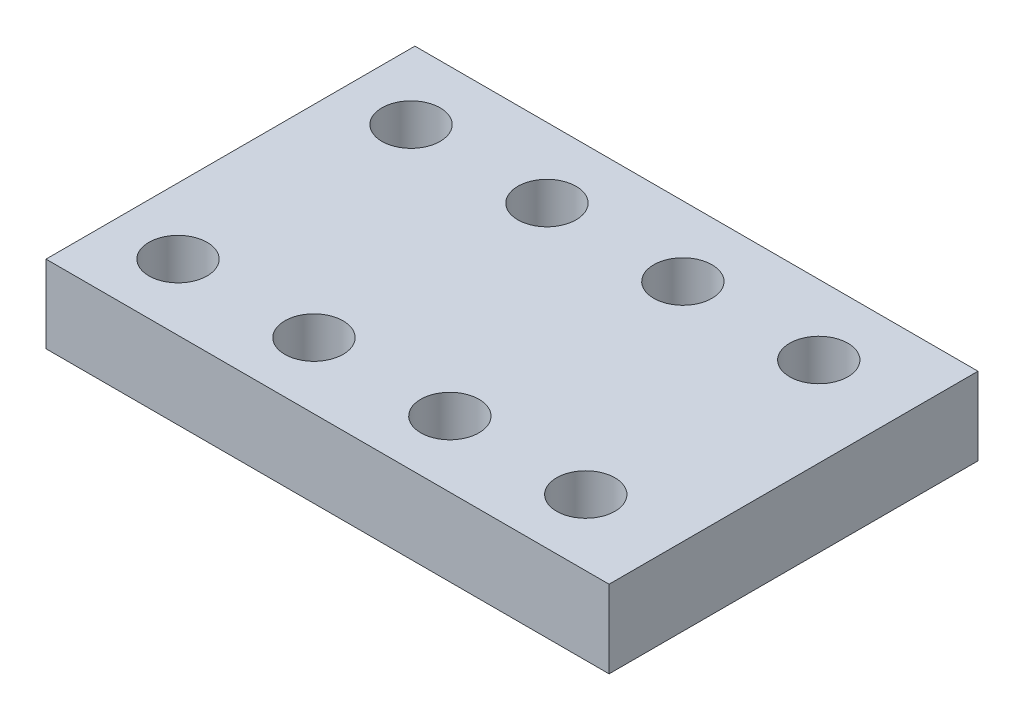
ISO-10303-21;
HEADER;
FILE_DESCRIPTION(('STEP AP214'),'2;1');
FILE_NAME('part.step','',(''),(''),'','','');
FILE_SCHEMA(('AUTOMOTIVE_DESIGN { 1 0 10303 214 1 1 1 1 }'));
ENDSEC;
DATA;
#1=APPLICATION_CONTEXT('core data for automotive mechanical design processes');
#2=APPLICATION_PROTOCOL_DEFINITION('international standard','automotive_design',2000,#1);
#3=PRODUCT_CONTEXT('',#1,'mechanical');
#4=PRODUCT('Part','Part','',(#3));
#5=PRODUCT_RELATED_PRODUCT_CATEGORY('part','',(#4));
#6=PRODUCT_DEFINITION_FORMATION('','',#4);
#7=PRODUCT_DEFINITION_CONTEXT('part definition',#1,'design');
#8=PRODUCT_DEFINITION('design','',#6,#7);
#9=PRODUCT_DEFINITION_SHAPE('','',#8);
#10=(LENGTH_UNIT() NAMED_UNIT(*) SI_UNIT(.MILLI.,.METRE.));
#11=(NAMED_UNIT(*) PLANE_ANGLE_UNIT() SI_UNIT($,.RADIAN.));
#12=(NAMED_UNIT(*) SI_UNIT($,.STERADIAN.) SOLID_ANGLE_UNIT());
#13=UNCERTAINTY_MEASURE_WITH_UNIT(LENGTH_MEASURE(1.E-05),#10,'distance_accuracy_value','');
#14=(GEOMETRIC_REPRESENTATION_CONTEXT(3) GLOBAL_UNCERTAINTY_ASSIGNED_CONTEXT((#13)) GLOBAL_UNIT_ASSIGNED_CONTEXT((#10,
#11,#12)) REPRESENTATION_CONTEXT('',''));
#15=CARTESIAN_POINT('',(0.,0.,0.));
#16=DIRECTION('',(0.,0.,1.));
#17=DIRECTION('',(1.,0.,0.));
#18=AXIS2_PLACEMENT_3D('',#15,#16,#17);
#19=CARTESIAN_POINT('',(-72.5,20.,-47.5));
#20=DIRECTION('',(1.,0.,0.));
#21=DIRECTION('',(0.,0.,-1.));
#22=AXIS2_PLACEMENT_3D('',#19,#20,#21);
#23=PLANE('',#22);
#24=DIRECTION('',(0.,0.,1.));
#25=VECTOR('',#24,1.);
#26=CARTESIAN_POINT('',(-72.5,0.,-47.5));
#27=LINE('',#26,#25);
#28=CARTESIAN_POINT('',(-72.5,0.,-47.5));
#29=VERTEX_POINT('',#28);
#30=CARTESIAN_POINT('',(-72.5,0.,47.5));
#31=VERTEX_POINT('',#30);
#32=EDGE_CURVE('E79',#29,#31,#27,.T.);
#33=ORIENTED_EDGE('',*,*,#32,.T.);
#34=DIRECTION('',(0.,-1.,0.));
#35=VECTOR('',#34,1.);
#36=CARTESIAN_POINT('',(-72.5,20.,47.5));
#37=LINE('',#36,#35);
#38=CARTESIAN_POINT('',(-72.5,20.,47.5));
#39=VERTEX_POINT('',#38);
#40=EDGE_CURVE('E86',#39,#31,#37,.T.);
#41=ORIENTED_EDGE('',*,*,#40,.F.);
#42=DIRECTION('',(0.,0.,1.));
#43=VECTOR('',#42,1.);
#44=CARTESIAN_POINT('',(-72.5,20.,-47.5));
#45=LINE('',#44,#43);
#46=CARTESIAN_POINT('',(-72.5,20.,-47.5));
#47=VERTEX_POINT('',#46);
#48=EDGE_CURVE('E106',#47,#39,#45,.T.);
#49=ORIENTED_EDGE('',*,*,#48,.F.);
#50=DIRECTION('',(0.,-1.,0.));
#51=VECTOR('',#50,1.);
#52=CARTESIAN_POINT('',(-72.5,20.,-47.5));
#53=LINE('',#52,#51);
#54=EDGE_CURVE('E95',#47,#29,#53,.T.);
#55=ORIENTED_EDGE('',*,*,#54,.T.);
#56=EDGE_LOOP('',(#33,#41,#49,#55));
#57=FACE_BOUND('',#56,.T.);
#58=ADVANCED_FACE('F32',(#57),#23,.F.);
#59=CARTESIAN_POINT('',(-72.5,20.,47.5));
#60=DIRECTION('',(0.,0.,-1.));
#61=DIRECTION('',(-1.,0.,0.));
#62=AXIS2_PLACEMENT_3D('',#59,#60,#61);
#63=PLANE('',#62);
#64=DIRECTION('',(1.,0.,0.));
#65=VECTOR('',#64,1.);
#66=CARTESIAN_POINT('',(-72.5,0.,47.5));
#67=LINE('',#66,#65);
#68=CARTESIAN_POINT('',(72.5,0.,47.5));
#69=VERTEX_POINT('',#68);
#70=EDGE_CURVE('E73',#31,#69,#67,.T.);
#71=ORIENTED_EDGE('',*,*,#70,.T.);
#72=DIRECTION('',(0.,-1.,0.));
#73=VECTOR('',#72,1.);
#74=CARTESIAN_POINT('',(72.5,20.,47.5));
#75=LINE('',#74,#73);
#76=CARTESIAN_POINT('',(72.5,20.,47.5));
#77=VERTEX_POINT('',#76);
#78=EDGE_CURVE('E92',#77,#69,#75,.T.);
#79=ORIENTED_EDGE('',*,*,#78,.F.);
#80=DIRECTION('',(1.,0.,0.));
#81=VECTOR('',#80,1.);
#82=CARTESIAN_POINT('',(-72.5,20.,47.5));
#83=LINE('',#82,#81);
#84=EDGE_CURVE('E88',#39,#77,#83,.T.);
#85=ORIENTED_EDGE('',*,*,#84,.F.);
#86=ORIENTED_EDGE('',*,*,#40,.T.);
#87=EDGE_LOOP('',(#71,#79,#85,#86));
#88=FACE_BOUND('',#87,.T.);
#89=ADVANCED_FACE('F87',(#88),#63,.F.);
#90=CARTESIAN_POINT('',(72.5,20.,-47.5));
#91=DIRECTION('',(-1.,0.,0.));
#92=DIRECTION('',(0.,0.,1.));
#93=AXIS2_PLACEMENT_3D('',#90,#91,#92);
#94=PLANE('',#93);
#95=DIRECTION('',(0.,0.,-1.));
#96=VECTOR('',#95,1.);
#97=CARTESIAN_POINT('',(72.5,0.,-47.5));
#98=LINE('',#97,#96);
#99=CARTESIAN_POINT('',(72.5,0.,-47.5));
#100=VERTEX_POINT('',#99);
#101=EDGE_CURVE('E80',#69,#100,#98,.T.);
#102=ORIENTED_EDGE('',*,*,#101,.T.);
#103=DIRECTION('',(0.,-1.,0.));
#104=VECTOR('',#103,1.);
#105=CARTESIAN_POINT('',(72.5,20.,-47.5));
#106=LINE('',#105,#104);
#107=CARTESIAN_POINT('',(72.5,20.,-47.5));
#108=VERTEX_POINT('',#107);
#109=EDGE_CURVE('E112',#108,#100,#106,.T.);
#110=ORIENTED_EDGE('',*,*,#109,.F.);
#111=DIRECTION('',(0.,0.,-1.));
#112=VECTOR('',#111,1.);
#113=CARTESIAN_POINT('',(72.5,20.,-47.5));
#114=LINE('',#113,#112);
#115=EDGE_CURVE('E52',#77,#108,#114,.T.);
#116=ORIENTED_EDGE('',*,*,#115,.F.);
#117=ORIENTED_EDGE('',*,*,#78,.T.);
#118=EDGE_LOOP('',(#102,#110,#116,#117));
#119=FACE_BOUND('',#118,.T.);
#120=ADVANCED_FACE('F165',(#119),#94,.F.);
#121=CARTESIAN_POINT('',(-72.5,20.,-47.5));
#122=DIRECTION('',(0.,0.,1.));
#123=DIRECTION('',(1.,0.,0.));
#124=AXIS2_PLACEMENT_3D('',#121,#122,#123);
#125=PLANE('',#124);
#126=DIRECTION('',(-1.,0.,0.));
#127=VECTOR('',#126,1.);
#128=CARTESIAN_POINT('',(-72.5,0.,-47.5));
#129=LINE('',#128,#127);
#130=EDGE_CURVE('E104',#100,#29,#129,.T.);
#131=ORIENTED_EDGE('',*,*,#130,.T.);
#132=ORIENTED_EDGE('',*,*,#54,.F.);
#133=DIRECTION('',(-1.,0.,0.));
#134=VECTOR('',#133,1.);
#135=CARTESIAN_POINT('',(-72.5,20.,-47.5));
#136=LINE('',#135,#134);
#137=EDGE_CURVE('E47',#108,#47,#136,.T.);
#138=ORIENTED_EDGE('',*,*,#137,.F.);
#139=ORIENTED_EDGE('',*,*,#109,.T.);
#140=EDGE_LOOP('',(#131,#132,#138,#139));
#141=FACE_BOUND('',#140,.T.);
#142=ADVANCED_FACE('F155',(#141),#125,.F.);
#143=CARTESIAN_POINT('',(-72.5,20.,47.5));
#144=DIRECTION('',(0.,1.,0.));
#145=DIRECTION('',(0.,0.,1.));
#146=AXIS2_PLACEMENT_3D('',#143,#144,#145);
#147=PLANE('',#146);
#148=CARTESIAN_POINT('',(-20.5,20.,30.5));
#149=DIRECTION('',(0.,1.,0.));
#150=DIRECTION('',(0.,0.,1.));
#151=AXIS2_PLACEMENT_3D('',#148,#149,#150);
#152=CIRCLE('',#151,7.5);
#153=CARTESIAN_POINT('',(-20.5,20.,38.));
#154=VERTEX_POINT('',#153);
#155=EDGE_CURVE('E305',#154,#154,#152,.T.);
#156=ORIENTED_EDGE('',*,*,#155,.F.);
#157=EDGE_LOOP('',(#156));
#158=FACE_BOUND('',#157,.T.);
#159=CARTESIAN_POINT('',(-55.5,20.,30.5));
#160=DIRECTION('',(0.,1.,0.));
#161=DIRECTION('',(0.,0.,1.));
#162=AXIS2_PLACEMENT_3D('',#159,#160,#161);
#163=CIRCLE('',#162,7.5);
#164=CARTESIAN_POINT('',(-55.5,20.,38.));
#165=VERTEX_POINT('',#164);
#166=EDGE_CURVE('E99',#165,#165,#163,.T.);
#167=ORIENTED_EDGE('',*,*,#166,.F.);
#168=EDGE_LOOP('',(#167));
#169=FACE_BOUND('',#168,.T.);
#170=ORIENTED_EDGE('',*,*,#48,.T.);
#171=ORIENTED_EDGE('',*,*,#84,.T.);
#172=ORIENTED_EDGE('',*,*,#115,.T.);
#173=ORIENTED_EDGE('',*,*,#137,.T.);
#174=EDGE_LOOP('',(#170,#171,#172,#173));
#175=FACE_BOUND('',#174,.T.);
#176=CARTESIAN_POINT('',(14.5,20.,30.5));
#177=DIRECTION('',(0.,1.,0.));
#178=DIRECTION('',(0.,0.,1.));
#179=AXIS2_PLACEMENT_3D('',#176,#177,#178);
#180=CIRCLE('',#179,7.5);
#181=CARTESIAN_POINT('',(14.5,20.,38.));
#182=VERTEX_POINT('',#181);
#183=EDGE_CURVE('E118',#182,#182,#180,.T.);
#184=ORIENTED_EDGE('',*,*,#183,.F.);
#185=EDGE_LOOP('',(#184));
#186=FACE_BOUND('',#185,.T.);
#187=CARTESIAN_POINT('',(49.5,20.,30.5));
#188=DIRECTION('',(0.,1.,0.));
#189=DIRECTION('',(0.,0.,1.));
#190=AXIS2_PLACEMENT_3D('',#187,#188,#189);
#191=CIRCLE('',#190,7.5);
#192=CARTESIAN_POINT('',(49.5,20.,38.));
#193=VERTEX_POINT('',#192);
#194=EDGE_CURVE('E124',#193,#193,#191,.T.);
#195=ORIENTED_EDGE('',*,*,#194,.F.);
#196=EDGE_LOOP('',(#195));
#197=FACE_BOUND('',#196,.T.);
#198=CARTESIAN_POINT('',(-55.5,20.,-29.5));
#199=DIRECTION('',(0.,1.,0.));
#200=DIRECTION('',(0.,0.,1.));
#201=AXIS2_PLACEMENT_3D('',#198,#199,#200);
#202=CIRCLE('',#201,7.5);
#203=CARTESIAN_POINT('',(-55.5,20.,-22.));
#204=VERTEX_POINT('',#203);
#205=EDGE_CURVE('E130',#204,#204,#202,.T.);
#206=ORIENTED_EDGE('',*,*,#205,.F.);
#207=EDGE_LOOP('',(#206));
#208=FACE_BOUND('',#207,.T.);
#209=CARTESIAN_POINT('',(-20.5,20.,-29.5));
#210=DIRECTION('',(0.,1.,0.));
#211=DIRECTION('',(0.,0.,1.));
#212=AXIS2_PLACEMENT_3D('',#209,#210,#211);
#213=CIRCLE('',#212,7.5);
#214=CARTESIAN_POINT('',(-20.5,20.,-22.));
#215=VERTEX_POINT('',#214);
#216=EDGE_CURVE('E136',#215,#215,#213,.T.);
#217=ORIENTED_EDGE('',*,*,#216,.F.);
#218=EDGE_LOOP('',(#217));
#219=FACE_BOUND('',#218,.T.);
#220=CARTESIAN_POINT('',(14.5,20.,-29.5));
#221=DIRECTION('',(0.,1.,0.));
#222=DIRECTION('',(0.,0.,1.));
#223=AXIS2_PLACEMENT_3D('',#220,#221,#222);
#224=CIRCLE('',#223,7.5);
#225=CARTESIAN_POINT('',(14.5,20.,-22.));
#226=VERTEX_POINT('',#225);
#227=EDGE_CURVE('E142',#226,#226,#224,.T.);
#228=ORIENTED_EDGE('',*,*,#227,.F.);
#229=EDGE_LOOP('',(#228));
#230=FACE_BOUND('',#229,.T.);
#231=CARTESIAN_POINT('',(49.5,20.,-29.5));
#232=DIRECTION('',(0.,1.,0.));
#233=DIRECTION('',(0.,0.,1.));
#234=AXIS2_PLACEMENT_3D('',#231,#232,#233);
#235=CIRCLE('',#234,7.5);
#236=CARTESIAN_POINT('',(49.5,20.,-22.));
#237=VERTEX_POINT('',#236);
#238=EDGE_CURVE('E11',#237,#237,#235,.T.);
#239=ORIENTED_EDGE('',*,*,#238,.F.);
#240=EDGE_LOOP('',(#239));
#241=FACE_BOUND('',#240,.T.);
#242=ADVANCED_FACE('F153',(#158,#169,#175,#186,#197,#208,#219,#230,#241),#147,.T.);
#243=CARTESIAN_POINT('',(-72.5,0.,47.5));
#244=DIRECTION('',(0.,1.,0.));
#245=DIRECTION('',(0.,0.,1.));
#246=AXIS2_PLACEMENT_3D('',#243,#244,#245);
#247=PLANE('',#246);
#248=CARTESIAN_POINT('',(-20.5,0.,30.5));
#249=DIRECTION('',(0.,1.,0.));
#250=DIRECTION('',(0.,0.,1.));
#251=AXIS2_PLACEMENT_3D('',#248,#249,#250);
#252=CIRCLE('',#251,7.5);
#253=CARTESIAN_POINT('',(-20.5,0.,38.));
#254=VERTEX_POINT('',#253);
#255=EDGE_CURVE('E307',#254,#254,#252,.T.);
#256=ORIENTED_EDGE('',*,*,#255,.T.);
#257=EDGE_LOOP('',(#256));
#258=FACE_BOUND('',#257,.T.);
#259=CARTESIAN_POINT('',(-55.5,0.,30.5));
#260=DIRECTION('',(0.,1.,0.));
#261=DIRECTION('',(0.,0.,1.));
#262=AXIS2_PLACEMENT_3D('',#259,#260,#261);
#263=CIRCLE('',#262,7.5);
#264=CARTESIAN_POINT('',(-55.5,0.,38.));
#265=VERTEX_POINT('',#264);
#266=EDGE_CURVE('E96',#265,#265,#263,.T.);
#267=ORIENTED_EDGE('',*,*,#266,.T.);
#268=EDGE_LOOP('',(#267));
#269=FACE_BOUND('',#268,.T.);
#270=ORIENTED_EDGE('',*,*,#32,.F.);
#271=ORIENTED_EDGE('',*,*,#130,.F.);
#272=ORIENTED_EDGE('',*,*,#101,.F.);
#273=ORIENTED_EDGE('',*,*,#70,.F.);
#274=EDGE_LOOP('',(#270,#271,#272,#273));
#275=FACE_BOUND('',#274,.T.);
#276=CARTESIAN_POINT('',(14.5,0.,30.5));
#277=DIRECTION('',(0.,1.,0.));
#278=DIRECTION('',(0.,0.,1.));
#279=AXIS2_PLACEMENT_3D('',#276,#277,#278);
#280=CIRCLE('',#279,7.5);
#281=CARTESIAN_POINT('',(14.5,0.,38.));
#282=VERTEX_POINT('',#281);
#283=EDGE_CURVE('E91',#282,#282,#280,.T.);
#284=ORIENTED_EDGE('',*,*,#283,.T.);
#285=EDGE_LOOP('',(#284));
#286=FACE_BOUND('',#285,.T.);
#287=CARTESIAN_POINT('',(49.5,0.,30.5));
#288=DIRECTION('',(0.,1.,0.));
#289=DIRECTION('',(0.,0.,1.));
#290=AXIS2_PLACEMENT_3D('',#287,#288,#289);
#291=CIRCLE('',#290,7.5);
#292=CARTESIAN_POINT('',(49.5,0.,38.));
#293=VERTEX_POINT('',#292);
#294=EDGE_CURVE('E121',#293,#293,#291,.T.);
#295=ORIENTED_EDGE('',*,*,#294,.T.);
#296=EDGE_LOOP('',(#295));
#297=FACE_BOUND('',#296,.T.);
#298=CARTESIAN_POINT('',(-55.5,0.,-29.5));
#299=DIRECTION('',(0.,1.,0.));
#300=DIRECTION('',(0.,0.,1.));
#301=AXIS2_PLACEMENT_3D('',#298,#299,#300);
#302=CIRCLE('',#301,7.5);
#303=CARTESIAN_POINT('',(-55.5,0.,-22.));
#304=VERTEX_POINT('',#303);
#305=EDGE_CURVE('E127',#304,#304,#302,.T.);
#306=ORIENTED_EDGE('',*,*,#305,.T.);
#307=EDGE_LOOP('',(#306));
#308=FACE_BOUND('',#307,.T.);
#309=CARTESIAN_POINT('',(-20.5,0.,-29.5));
#310=DIRECTION('',(0.,1.,0.));
#311=DIRECTION('',(0.,0.,1.));
#312=AXIS2_PLACEMENT_3D('',#309,#310,#311);
#313=CIRCLE('',#312,7.5);
#314=CARTESIAN_POINT('',(-20.5,0.,-22.));
#315=VERTEX_POINT('',#314);
#316=EDGE_CURVE('E133',#315,#315,#313,.T.);
#317=ORIENTED_EDGE('',*,*,#316,.T.);
#318=EDGE_LOOP('',(#317));
#319=FACE_BOUND('',#318,.T.);
#320=CARTESIAN_POINT('',(14.5,0.,-29.5));
#321=DIRECTION('',(0.,1.,0.));
#322=DIRECTION('',(0.,0.,1.));
#323=AXIS2_PLACEMENT_3D('',#320,#321,#322);
#324=CIRCLE('',#323,7.5);
#325=CARTESIAN_POINT('',(14.5,0.,-22.));
#326=VERTEX_POINT('',#325);
#327=EDGE_CURVE('E139',#326,#326,#324,.T.);
#328=ORIENTED_EDGE('',*,*,#327,.T.);
#329=EDGE_LOOP('',(#328));
#330=FACE_BOUND('',#329,.T.);
#331=CARTESIAN_POINT('',(49.5,0.,-29.5));
#332=DIRECTION('',(0.,1.,0.));
#333=DIRECTION('',(0.,0.,1.));
#334=AXIS2_PLACEMENT_3D('',#331,#332,#333);
#335=CIRCLE('',#334,7.5);
#336=CARTESIAN_POINT('',(49.5,0.,-22.));
#337=VERTEX_POINT('',#336);
#338=EDGE_CURVE('E40',#337,#337,#335,.T.);
#339=ORIENTED_EDGE('',*,*,#338,.T.);
#340=EDGE_LOOP('',(#339));
#341=FACE_BOUND('',#340,.T.);
#342=ADVANCED_FACE('F75',(#258,#269,#275,#286,#297,#308,#319,#330,#341),#247,.F.);
#343=CARTESIAN_POINT('',(-55.5,0.,30.5));
#344=DIRECTION('',(0.,1.,0.));
#345=DIRECTION('',(0.,0.,1.));
#346=AXIS2_PLACEMENT_3D('',#343,#344,#345);
#347=CYLINDRICAL_SURFACE('',#346,7.5);
#348=ORIENTED_EDGE('',*,*,#266,.F.);
#349=EDGE_LOOP('',(#348));
#350=FACE_BOUND('',#349,.T.);
#351=ORIENTED_EDGE('',*,*,#166,.T.);
#352=EDGE_LOOP('',(#351));
#353=FACE_BOUND('',#352,.T.);
#354=ADVANCED_FACE('F162',(#350,#353),#347,.F.);
#355=CARTESIAN_POINT('',(-20.5,0.,30.5));
#356=DIRECTION('',(0.,1.,0.));
#357=DIRECTION('',(0.,0.,1.));
#358=AXIS2_PLACEMENT_3D('',#355,#356,#357);
#359=CYLINDRICAL_SURFACE('',#358,7.5);
#360=ORIENTED_EDGE('',*,*,#255,.F.);
#361=EDGE_LOOP('',(#360));
#362=FACE_BOUND('',#361,.T.);
#363=ORIENTED_EDGE('',*,*,#155,.T.);
#364=EDGE_LOOP('',(#363));
#365=FACE_BOUND('',#364,.T.);
#366=ADVANCED_FACE('F182',(#362,#365),#359,.F.);
#367=CARTESIAN_POINT('',(14.5,0.,30.5));
#368=DIRECTION('',(0.,1.,0.));
#369=DIRECTION('',(0.,0.,1.));
#370=AXIS2_PLACEMENT_3D('',#367,#368,#369);
#371=CYLINDRICAL_SURFACE('',#370,7.5);
#372=ORIENTED_EDGE('',*,*,#283,.F.);
#373=EDGE_LOOP('',(#372));
#374=FACE_BOUND('',#373,.T.);
#375=ORIENTED_EDGE('',*,*,#183,.T.);
#376=EDGE_LOOP('',(#375));
#377=FACE_BOUND('',#376,.T.);
#378=ADVANCED_FACE('F178',(#374,#377),#371,.F.);
#379=CARTESIAN_POINT('',(49.5,0.,30.5));
#380=DIRECTION('',(0.,1.,0.));
#381=DIRECTION('',(0.,0.,1.));
#382=AXIS2_PLACEMENT_3D('',#379,#380,#381);
#383=CYLINDRICAL_SURFACE('',#382,7.5);
#384=ORIENTED_EDGE('',*,*,#294,.F.);
#385=EDGE_LOOP('',(#384));
#386=FACE_BOUND('',#385,.T.);
#387=ORIENTED_EDGE('',*,*,#194,.T.);
#388=EDGE_LOOP('',(#387));
#389=FACE_BOUND('',#388,.T.);
#390=ADVANCED_FACE('F181',(#386,#389),#383,.F.);
#391=CARTESIAN_POINT('',(-55.5,0.,-29.5));
#392=DIRECTION('',(0.,1.,0.));
#393=DIRECTION('',(0.,0.,1.));
#394=AXIS2_PLACEMENT_3D('',#391,#392,#393);
#395=CYLINDRICAL_SURFACE('',#394,7.5);
#396=ORIENTED_EDGE('',*,*,#305,.F.);
#397=EDGE_LOOP('',(#396));
#398=FACE_BOUND('',#397,.T.);
#399=ORIENTED_EDGE('',*,*,#205,.T.);
#400=EDGE_LOOP('',(#399));
#401=FACE_BOUND('',#400,.T.);
#402=ADVANCED_FACE('F186',(#398,#401),#395,.F.);
#403=CARTESIAN_POINT('',(-20.5,0.,-29.5));
#404=DIRECTION('',(0.,1.,0.));
#405=DIRECTION('',(0.,0.,1.));
#406=AXIS2_PLACEMENT_3D('',#403,#404,#405);
#407=CYLINDRICAL_SURFACE('',#406,7.5);
#408=ORIENTED_EDGE('',*,*,#316,.F.);
#409=EDGE_LOOP('',(#408));
#410=FACE_BOUND('',#409,.T.);
#411=ORIENTED_EDGE('',*,*,#216,.T.);
#412=EDGE_LOOP('',(#411));
#413=FACE_BOUND('',#412,.T.);
#414=ADVANCED_FACE('F190',(#410,#413),#407,.F.);
#415=CARTESIAN_POINT('',(14.5,0.,-29.5));
#416=DIRECTION('',(0.,1.,0.));
#417=DIRECTION('',(0.,0.,1.));
#418=AXIS2_PLACEMENT_3D('',#415,#416,#417);
#419=CYLINDRICAL_SURFACE('',#418,7.5);
#420=ORIENTED_EDGE('',*,*,#327,.F.);
#421=EDGE_LOOP('',(#420));
#422=FACE_BOUND('',#421,.T.);
#423=ORIENTED_EDGE('',*,*,#227,.T.);
#424=EDGE_LOOP('',(#423));
#425=FACE_BOUND('',#424,.T.);
#426=ADVANCED_FACE('F150',(#422,#425),#419,.F.);
#427=CARTESIAN_POINT('',(49.5,0.,-29.5));
#428=DIRECTION('',(0.,1.,0.));
#429=DIRECTION('',(0.,0.,1.));
#430=AXIS2_PLACEMENT_3D('',#427,#428,#429);
#431=CYLINDRICAL_SURFACE('',#430,7.5);
#432=ORIENTED_EDGE('',*,*,#338,.F.);
#433=EDGE_LOOP('',(#432));
#434=FACE_BOUND('',#433,.T.);
#435=ORIENTED_EDGE('',*,*,#238,.T.);
#436=EDGE_LOOP('',(#435));
#437=FACE_BOUND('',#436,.T.);
#438=ADVANCED_FACE('F34',(#434,#437),#431,.F.);
#439=CLOSED_SHELL('',(#58,#89,#120,#142,#242,#342,#354,#366,#378,#390,#402,#414,#426,#438));
#440=MANIFOLD_SOLID_BREP('B2',#439);
#441=ADVANCED_BREP_SHAPE_REPRESENTATION('',(#18,#440),#14);
#442=SHAPE_DEFINITION_REPRESENTATION(#9,#441);
ENDSEC;
END-ISO-10303-21;
